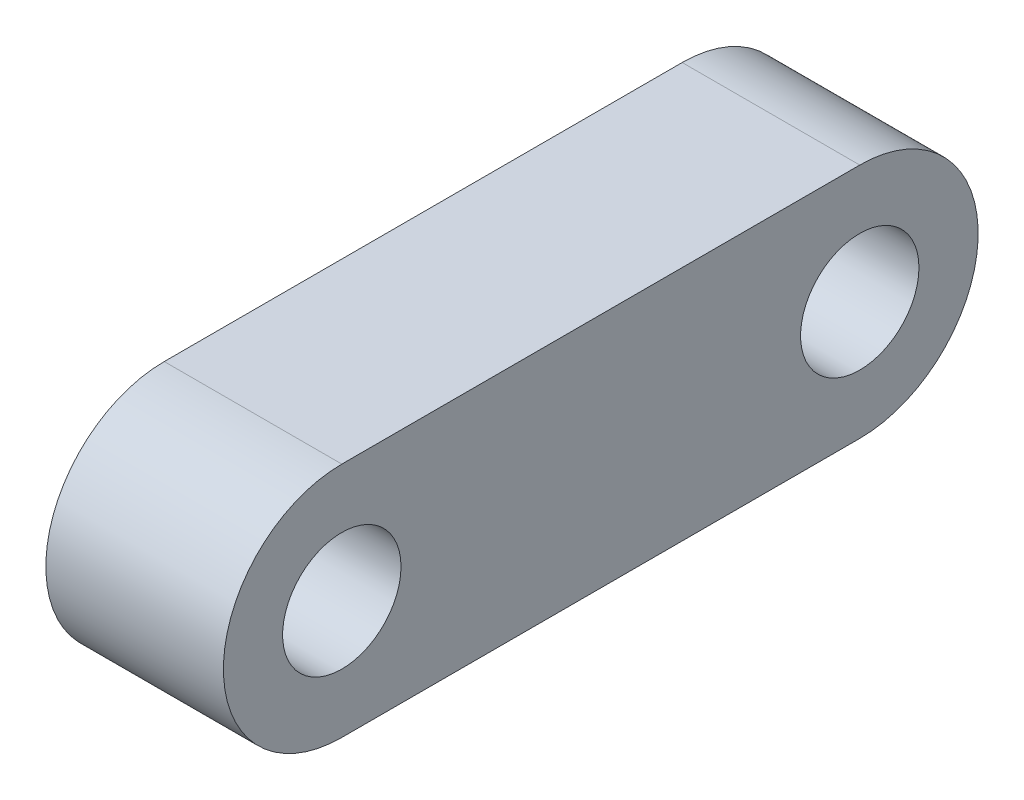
ISO-10303-21;
HEADER;
FILE_DESCRIPTION(('STEP AP214'),'2;1');
FILE_NAME('part.step','',(''),(''),'','','');
FILE_SCHEMA(('AUTOMOTIVE_DESIGN { 1 0 10303 214 1 1 1 1 }'));
ENDSEC;
DATA;
#1=APPLICATION_CONTEXT('core data for automotive mechanical design processes');
#2=APPLICATION_PROTOCOL_DEFINITION('international standard','automotive_design',2000,#1);
#3=PRODUCT_CONTEXT('',#1,'mechanical');
#4=PRODUCT('Part','Part','',(#3));
#5=PRODUCT_RELATED_PRODUCT_CATEGORY('part','',(#4));
#6=PRODUCT_DEFINITION_FORMATION('','',#4);
#7=PRODUCT_DEFINITION_CONTEXT('part definition',#1,'design');
#8=PRODUCT_DEFINITION('design','',#6,#7);
#9=PRODUCT_DEFINITION_SHAPE('','',#8);
#10=(LENGTH_UNIT() NAMED_UNIT(*) SI_UNIT(.MILLI.,.METRE.));
#11=(NAMED_UNIT(*) PLANE_ANGLE_UNIT() SI_UNIT($,.RADIAN.));
#12=(NAMED_UNIT(*) SI_UNIT($,.STERADIAN.) SOLID_ANGLE_UNIT());
#13=UNCERTAINTY_MEASURE_WITH_UNIT(LENGTH_MEASURE(1.E-05),#10,'distance_accuracy_value','');
#14=(GEOMETRIC_REPRESENTATION_CONTEXT(3) GLOBAL_UNCERTAINTY_ASSIGNED_CONTEXT((#13)) GLOBAL_UNIT_ASSIGNED_CONTEXT((#10,
#11,#12)) REPRESENTATION_CONTEXT('',''));
#15=CARTESIAN_POINT('',(0.,0.,0.));
#16=DIRECTION('',(0.,0.,1.));
#17=DIRECTION('',(1.,0.,0.));
#18=AXIS2_PLACEMENT_3D('',#15,#16,#17);
#19=CARTESIAN_POINT('',(30.,0.,87.5));
#20=DIRECTION('',(1.,0.,0.));
#21=DIRECTION('',(0.,0.,-1.));
#22=AXIS2_PLACEMENT_3D('',#19,#20,#21);
#23=PLANE('',#22);
#24=CARTESIAN_POINT('',(30.,0.,87.5));
#25=DIRECTION('',(1.,0.,0.));
#26=DIRECTION('',(0.,0.,-1.));
#27=AXIS2_PLACEMENT_3D('',#24,#25,#26);
#28=CIRCLE('',#27,20.);
#29=CARTESIAN_POINT('',(30.,0.,67.5));
#30=VERTEX_POINT('',#29);
#31=EDGE_CURVE('E105',#30,#30,#28,.T.);
#32=ORIENTED_EDGE('',*,*,#31,.F.);
#33=EDGE_LOOP('',(#32));
#34=FACE_BOUND('',#33,.T.);
#35=CARTESIAN_POINT('',(30.,0.,87.5));
#36=DIRECTION('',(1.,0.,0.));
#37=DIRECTION('',(0.,0.,-1.));
#38=AXIS2_PLACEMENT_3D('',#35,#36,#37);
#39=CIRCLE('',#38,40.);
#40=CARTESIAN_POINT('',(30.,40.,87.5));
#41=VERTEX_POINT('',#40);
#42=CARTESIAN_POINT('',(30.,-40.,87.5));
#43=VERTEX_POINT('',#42);
#44=EDGE_CURVE('E90',#41,#43,#39,.T.);
#45=ORIENTED_EDGE('',*,*,#44,.T.);
#46=DIRECTION('',(0.,0.,-1.));
#47=VECTOR('',#46,1.);
#48=CARTESIAN_POINT('',(30.,-40.,87.5));
#49=LINE('',#48,#47);
#50=CARTESIAN_POINT('',(30.,-40.,-87.5));
#51=VERTEX_POINT('',#50);
#52=EDGE_CURVE('E85',#43,#51,#49,.T.);
#53=ORIENTED_EDGE('',*,*,#52,.T.);
#54=CARTESIAN_POINT('',(30.,0.,-87.5));
#55=DIRECTION('',(1.,0.,0.));
#56=DIRECTION('',(0.,0.,-1.));
#57=AXIS2_PLACEMENT_3D('',#54,#55,#56);
#58=CIRCLE('',#57,40.);
#59=CARTESIAN_POINT('',(30.,40.,-87.5));
#60=VERTEX_POINT('',#59);
#61=EDGE_CURVE('E88',#51,#60,#58,.T.);
#62=ORIENTED_EDGE('',*,*,#61,.T.);
#63=DIRECTION('',(0.,0.,1.));
#64=VECTOR('',#63,1.);
#65=CARTESIAN_POINT('',(30.,40.,87.5));
#66=LINE('',#65,#64);
#67=EDGE_CURVE('E55',#60,#41,#66,.T.);
#68=ORIENTED_EDGE('',*,*,#67,.T.);
#69=EDGE_LOOP('',(#45,#53,#62,#68));
#70=FACE_BOUND('',#69,.T.);
#71=CARTESIAN_POINT('',(30.,0.,-87.5));
#72=DIRECTION('',(1.,0.,0.));
#73=DIRECTION('',(0.,0.,-1.));
#74=AXIS2_PLACEMENT_3D('',#71,#72,#73);
#75=CIRCLE('',#74,20.);
#76=CARTESIAN_POINT('',(30.,0.,-107.5));
#77=VERTEX_POINT('',#76);
#78=EDGE_CURVE('E120',#77,#77,#75,.T.);
#79=ORIENTED_EDGE('',*,*,#78,.F.);
#80=EDGE_LOOP('',(#79));
#81=FACE_BOUND('',#80,.T.);
#82=ADVANCED_FACE('F38',(#34,#70,#81),#23,.T.);
#83=CARTESIAN_POINT('',(-30.,0.,87.5));
#84=DIRECTION('',(1.,0.,0.));
#85=DIRECTION('',(0.,0.,-1.));
#86=AXIS2_PLACEMENT_3D('',#83,#84,#85);
#87=PLANE('',#86);
#88=CARTESIAN_POINT('',(-30.,0.,87.5));
#89=DIRECTION('',(1.,0.,0.));
#90=DIRECTION('',(0.,0.,-1.));
#91=AXIS2_PLACEMENT_3D('',#88,#89,#90);
#92=CIRCLE('',#91,40.);
#93=CARTESIAN_POINT('',(-30.,40.,87.5));
#94=VERTEX_POINT('',#93);
#95=CARTESIAN_POINT('',(-30.,-40.,87.5));
#96=VERTEX_POINT('',#95);
#97=EDGE_CURVE('E102',#94,#96,#92,.T.);
#98=ORIENTED_EDGE('',*,*,#97,.F.);
#99=DIRECTION('',(0.,0.,1.));
#100=VECTOR('',#99,1.);
#101=CARTESIAN_POINT('',(-30.,40.,87.5));
#102=LINE('',#101,#100);
#103=CARTESIAN_POINT('',(-30.,40.,-87.5));
#104=VERTEX_POINT('',#103);
#105=EDGE_CURVE('E78',#104,#94,#102,.T.);
#106=ORIENTED_EDGE('',*,*,#105,.F.);
#107=CARTESIAN_POINT('',(-30.,0.,-87.5));
#108=DIRECTION('',(1.,0.,0.));
#109=DIRECTION('',(0.,0.,-1.));
#110=AXIS2_PLACEMENT_3D('',#107,#108,#109);
#111=CIRCLE('',#110,40.);
#112=CARTESIAN_POINT('',(-30.,-40.,-87.5));
#113=VERTEX_POINT('',#112);
#114=EDGE_CURVE('E72',#113,#104,#111,.T.);
#115=ORIENTED_EDGE('',*,*,#114,.F.);
#116=DIRECTION('',(0.,0.,-1.));
#117=VECTOR('',#116,1.);
#118=CARTESIAN_POINT('',(-30.,-40.,87.5));
#119=LINE('',#118,#117);
#120=EDGE_CURVE('E94',#96,#113,#119,.T.);
#121=ORIENTED_EDGE('',*,*,#120,.F.);
#122=EDGE_LOOP('',(#98,#106,#115,#121));
#123=FACE_BOUND('',#122,.T.);
#124=CARTESIAN_POINT('',(-30.,0.,87.5));
#125=DIRECTION('',(1.,0.,0.));
#126=DIRECTION('',(0.,0.,-1.));
#127=AXIS2_PLACEMENT_3D('',#124,#125,#126);
#128=CIRCLE('',#127,20.);
#129=CARTESIAN_POINT('',(-30.,0.,67.5));
#130=VERTEX_POINT('',#129);
#131=EDGE_CURVE('E117',#130,#130,#128,.T.);
#132=ORIENTED_EDGE('',*,*,#131,.T.);
#133=EDGE_LOOP('',(#132));
#134=FACE_BOUND('',#133,.T.);
#135=CARTESIAN_POINT('',(-30.,0.,-87.5));
#136=DIRECTION('',(1.,0.,0.));
#137=DIRECTION('',(0.,0.,-1.));
#138=AXIS2_PLACEMENT_3D('',#135,#136,#137);
#139=CIRCLE('',#138,20.);
#140=CARTESIAN_POINT('',(-30.,0.,-107.5));
#141=VERTEX_POINT('',#140);
#142=EDGE_CURVE('E123',#141,#141,#139,.T.);
#143=ORIENTED_EDGE('',*,*,#142,.T.);
#144=EDGE_LOOP('',(#143));
#145=FACE_BOUND('',#144,.T.);
#146=ADVANCED_FACE('F113',(#123,#134,#145),#87,.F.);
#147=CARTESIAN_POINT('',(30.,0.,87.5));
#148=DIRECTION('',(-1.,0.,0.));
#149=DIRECTION('',(0.,0.,1.));
#150=AXIS2_PLACEMENT_3D('',#147,#148,#149);
#151=CYLINDRICAL_SURFACE('',#150,40.);
#152=ORIENTED_EDGE('',*,*,#97,.T.);
#153=DIRECTION('',(-1.,0.,0.));
#154=VECTOR('',#153,1.);
#155=CARTESIAN_POINT('',(30.,-40.,87.5));
#156=LINE('',#155,#154);
#157=EDGE_CURVE('E11',#43,#96,#156,.T.);
#158=ORIENTED_EDGE('',*,*,#157,.F.);
#159=ORIENTED_EDGE('',*,*,#44,.F.);
#160=DIRECTION('',(-1.,0.,0.));
#161=VECTOR('',#160,1.);
#162=CARTESIAN_POINT('',(30.,40.,87.5));
#163=LINE('',#162,#161);
#164=EDGE_CURVE('E98',#41,#94,#163,.T.);
#165=ORIENTED_EDGE('',*,*,#164,.T.);
#166=EDGE_LOOP('',(#152,#158,#159,#165));
#167=FACE_BOUND('',#166,.T.);
#168=ADVANCED_FACE('F40',(#167),#151,.T.);
#169=CARTESIAN_POINT('',(30.,-40.,87.5));
#170=DIRECTION('',(0.,1.,0.));
#171=DIRECTION('',(0.,0.,1.));
#172=AXIS2_PLACEMENT_3D('',#169,#170,#171);
#173=PLANE('',#172);
#174=ORIENTED_EDGE('',*,*,#120,.T.);
#175=DIRECTION('',(-1.,0.,0.));
#176=VECTOR('',#175,1.);
#177=CARTESIAN_POINT('',(30.,-40.,-87.5));
#178=LINE('',#177,#176);
#179=EDGE_CURVE('E47',#51,#113,#178,.T.);
#180=ORIENTED_EDGE('',*,*,#179,.F.);
#181=ORIENTED_EDGE('',*,*,#52,.F.);
#182=ORIENTED_EDGE('',*,*,#157,.T.);
#183=EDGE_LOOP('',(#174,#180,#181,#182));
#184=FACE_BOUND('',#183,.T.);
#185=ADVANCED_FACE('F93',(#184),#173,.F.);
#186=CARTESIAN_POINT('',(30.,0.,-87.5));
#187=DIRECTION('',(-1.,0.,0.));
#188=DIRECTION('',(0.,0.,1.));
#189=AXIS2_PLACEMENT_3D('',#186,#187,#188);
#190=CYLINDRICAL_SURFACE('',#189,40.);
#191=ORIENTED_EDGE('',*,*,#114,.T.);
#192=DIRECTION('',(-1.,0.,0.));
#193=VECTOR('',#192,1.);
#194=CARTESIAN_POINT('',(30.,40.,-87.5));
#195=LINE('',#194,#193);
#196=EDGE_CURVE('E95',#60,#104,#195,.T.);
#197=ORIENTED_EDGE('',*,*,#196,.F.);
#198=ORIENTED_EDGE('',*,*,#61,.F.);
#199=ORIENTED_EDGE('',*,*,#179,.T.);
#200=EDGE_LOOP('',(#191,#197,#198,#199));
#201=FACE_BOUND('',#200,.T.);
#202=ADVANCED_FACE('F96',(#201),#190,.T.);
#203=CARTESIAN_POINT('',(30.,40.,87.5));
#204=DIRECTION('',(0.,-1.,0.));
#205=DIRECTION('',(0.,0.,-1.));
#206=AXIS2_PLACEMENT_3D('',#203,#204,#205);
#207=PLANE('',#206);
#208=ORIENTED_EDGE('',*,*,#105,.T.);
#209=ORIENTED_EDGE('',*,*,#164,.F.);
#210=ORIENTED_EDGE('',*,*,#67,.F.);
#211=ORIENTED_EDGE('',*,*,#196,.T.);
#212=EDGE_LOOP('',(#208,#209,#210,#211));
#213=FACE_BOUND('',#212,.T.);
#214=ADVANCED_FACE('F110',(#213),#207,.F.);
#215=CARTESIAN_POINT('',(30.,0.,87.5));
#216=DIRECTION('',(-1.,0.,0.));
#217=DIRECTION('',(0.,0.,1.));
#218=AXIS2_PLACEMENT_3D('',#215,#216,#217);
#219=CYLINDRICAL_SURFACE('',#218,20.);
#220=ORIENTED_EDGE('',*,*,#31,.T.);
#221=EDGE_LOOP('',(#220));
#222=FACE_BOUND('',#221,.T.);
#223=ORIENTED_EDGE('',*,*,#131,.F.);
#224=EDGE_LOOP('',(#223));
#225=FACE_BOUND('',#224,.T.);
#226=ADVANCED_FACE('F140',(#222,#225),#219,.F.);
#227=CARTESIAN_POINT('',(30.,0.,-87.5));
#228=DIRECTION('',(-1.,0.,0.));
#229=DIRECTION('',(0.,0.,1.));
#230=AXIS2_PLACEMENT_3D('',#227,#228,#229);
#231=CYLINDRICAL_SURFACE('',#230,20.);
#232=ORIENTED_EDGE('',*,*,#78,.T.);
#233=EDGE_LOOP('',(#232));
#234=FACE_BOUND('',#233,.T.);
#235=ORIENTED_EDGE('',*,*,#142,.F.);
#236=EDGE_LOOP('',(#235));
#237=FACE_BOUND('',#236,.T.);
#238=ADVANCED_FACE('F129',(#234,#237),#231,.F.);
#239=CLOSED_SHELL('',(#82,#146,#168,#185,#202,#214,#226,#238));
#240=MANIFOLD_SOLID_BREP('B2',#239);
#241=ADVANCED_BREP_SHAPE_REPRESENTATION('',(#18,#240),#14);
#242=SHAPE_DEFINITION_REPRESENTATION(#9,#241);
ENDSEC;
END-ISO-10303-21;
